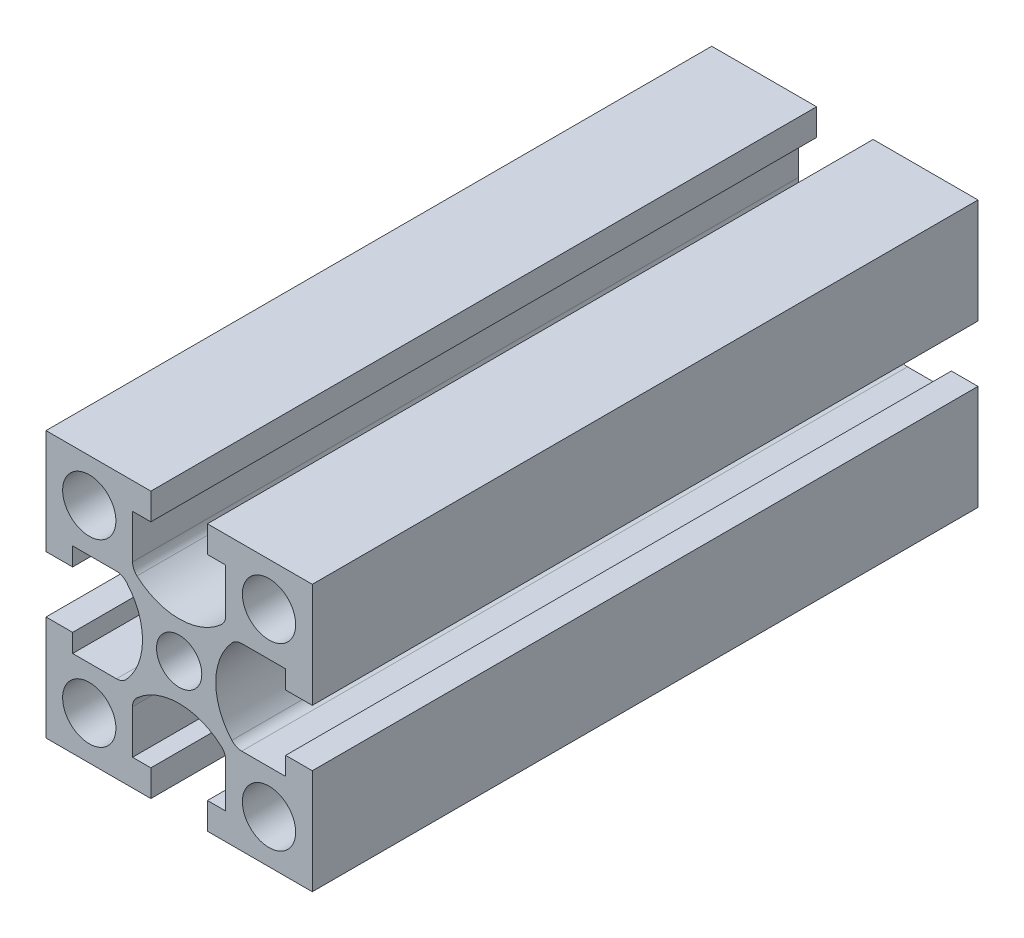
from build123d import *

# Parameters (mm, degrees)
SKETCH_1_W               = 40
SKETCH_1_H               = 40
EXTRUDE_1_DEPTH          = 50
SKETCH_2_R               = 3.4
CUT_EXTRUDE_1_DEPTH      = 104.923048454
SKETCH_3_R               = 4
CUT_EXTRUDE_2_DEPTH      = 104.923048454
PATTERN_CIRCULAR_1_COUNT = 4
CUT_EXTRUDE_3_DEPTH      = 104.923048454
PATTERN_CIRCULAR_2_COUNT = 4


with BuildPart() as part:
    # Sketch 1 → Extrude 1 (new, symmetric)
    with BuildSketch(Plane.XY):
        Rectangle(SKETCH_1_W, SKETCH_1_H)
    extrude(amount=EXTRUDE_1_DEPTH, both=True)

    # Sketch 2 → Cut-Extrude 1 (cut, through all)
    with BuildSketch(Plane.XY.offset(50)):
        Circle(SKETCH_2_R)
    extrude(amount=-CUT_EXTRUDE_1_DEPTH, mode=Mode.SUBTRACT)

    # Sketch 3 → Cut-Extrude 2 (cut, through all)
    with BuildSketch(Plane.XY.offset(50)):
        with Locations((-13.5, 13.5)):
            Circle(SKETCH_3_R)
    cut_extrude_2 = extrude(amount=-CUT_EXTRUDE_2_DEPTH, mode=Mode.SUBTRACT)

    # Pattern Circular 1: Cut-Extrude 2 ×4 about axis
    pattern_circular_1_axis = Axis((0, 0, 0), (0, 0, 1))
    for i in range(1, PATTERN_CIRCULAR_1_COUNT):
        add(cut_extrude_2.rotate(pattern_circular_1_axis, i * 360 / PATTERN_CIRCULAR_1_COUNT), mode=Mode.SUBTRACT)

    # Sketch 4 → Cut-Extrude 3 (cut, through all)
    with BuildSketch(Plane.XY.offset(50)):
        with BuildLine():
            Line((4.25, 20), (-4.25, 20))
            Line((-4.25, 20), (-4.25, 16))
            Line((-4.25, 16), (-7, 16))
            Line((-7, 16), (-7, 9.409830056))
            ThreePointArc((-7, 9.409830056), (-6.825741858, 8.593333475), (-6.333333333, 7.919118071))
            ThreePointArc((-6.333333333, 7.919118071), (0, 5.5), (6.333333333, 7.919118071))
            ThreePointArc((6.333333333, 7.919118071), (6.825741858, 8.593333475), (7, 9.409830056))
            Line((7, 9.409830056), (7, 16))
            Line((7, 16), (4.25, 16))
            Line((4.25, 16), (4.25, 20))
        make_face()
    cut_extrude_3 = extrude(amount=-CUT_EXTRUDE_3_DEPTH, mode=Mode.SUBTRACT)

    # Pattern Circular 2: Cut-Extrude 3 ×4 about axis
    pattern_circular_2_axis = Axis((0, 0, 0), (0, 0, 1))
    for i in range(1, PATTERN_CIRCULAR_2_COUNT):
        add(cut_extrude_3.rotate(pattern_circular_2_axis, i * 360 / PATTERN_CIRCULAR_2_COUNT), mode=Mode.SUBTRACT)


solid = part.part
